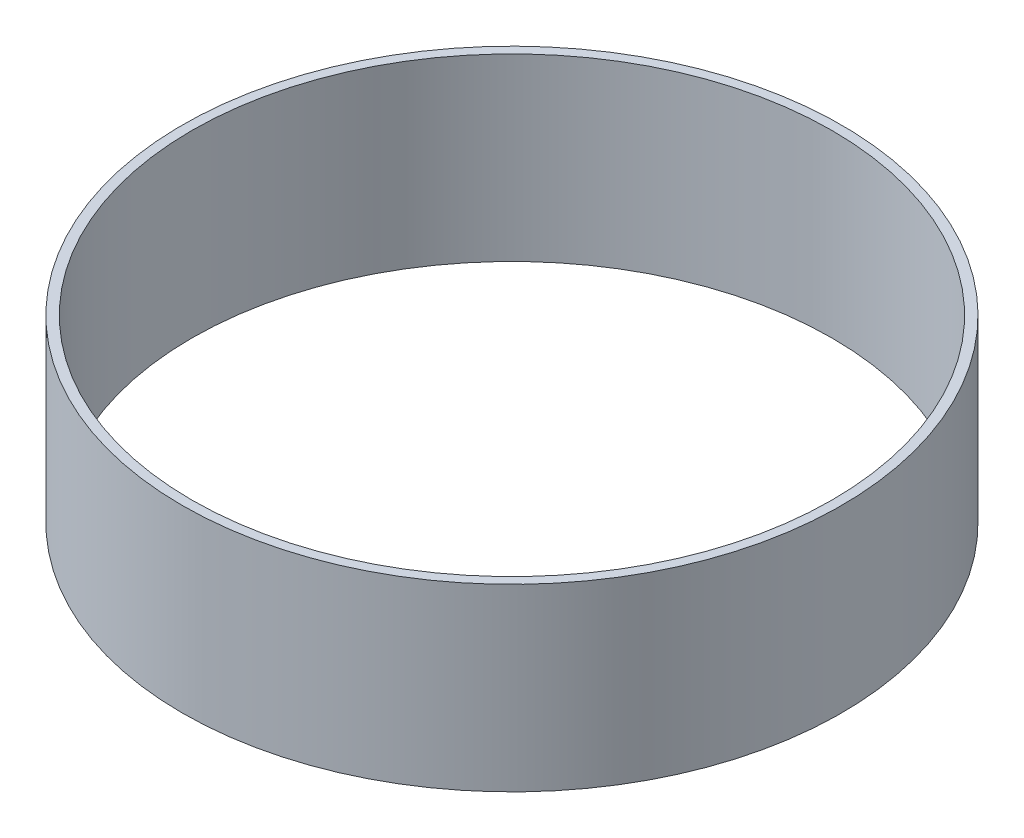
ISO-10303-21;
HEADER;
FILE_DESCRIPTION(('STEP AP214'),'2;1');
FILE_NAME('part.step','',(''),(''),'','','');
FILE_SCHEMA(('AUTOMOTIVE_DESIGN { 1 0 10303 214 1 1 1 1 }'));
ENDSEC;
DATA;
#1=APPLICATION_CONTEXT('core data for automotive mechanical design processes');
#2=APPLICATION_PROTOCOL_DEFINITION('international standard','automotive_design',2000,#1);
#3=PRODUCT_CONTEXT('',#1,'mechanical');
#4=PRODUCT('Part','Part','',(#3));
#5=PRODUCT_RELATED_PRODUCT_CATEGORY('part','',(#4));
#6=PRODUCT_DEFINITION_FORMATION('','',#4);
#7=PRODUCT_DEFINITION_CONTEXT('part definition',#1,'design');
#8=PRODUCT_DEFINITION('design','',#6,#7);
#9=PRODUCT_DEFINITION_SHAPE('','',#8);
#10=(LENGTH_UNIT() NAMED_UNIT(*) SI_UNIT(.MILLI.,.METRE.));
#11=(NAMED_UNIT(*) PLANE_ANGLE_UNIT() SI_UNIT($,.RADIAN.));
#12=(NAMED_UNIT(*) SI_UNIT($,.STERADIAN.) SOLID_ANGLE_UNIT());
#13=UNCERTAINTY_MEASURE_WITH_UNIT(LENGTH_MEASURE(1.E-05),#10,'distance_accuracy_value','');
#14=(GEOMETRIC_REPRESENTATION_CONTEXT(3) GLOBAL_UNCERTAINTY_ASSIGNED_CONTEXT((#13)) GLOBAL_UNIT_ASSIGNED_CONTEXT((#10,
#11,#12)) REPRESENTATION_CONTEXT('',''));
#15=CARTESIAN_POINT('',(0.,0.,0.));
#16=DIRECTION('',(0.,0.,1.));
#17=DIRECTION('',(1.,0.,0.));
#18=AXIS2_PLACEMENT_3D('',#15,#16,#17);
#19=CARTESIAN_POINT('',(0.,18.,0.));
#20=DIRECTION('',(0.,1.,0.));
#21=DIRECTION('',(0.,0.,1.));
#22=AXIS2_PLACEMENT_3D('',#19,#20,#21);
#23=PLANE('',#22);
#24=CARTESIAN_POINT('',(0.,18.,0.));
#25=DIRECTION('',(0.,1.,0.));
#26=DIRECTION('',(0.,0.,1.));
#27=AXIS2_PLACEMENT_3D('',#24,#25,#26);
#28=CIRCLE('',#27,33.);
#29=CARTESIAN_POINT('',(0.,18.,33.));
#30=VERTEX_POINT('',#29);
#31=EDGE_CURVE('E10',#30,#30,#28,.T.);
#32=ORIENTED_EDGE('',*,*,#31,.T.);
#33=EDGE_LOOP('',(#32));
#34=FACE_BOUND('',#33,.T.);
#35=CARTESIAN_POINT('',(0.,18.,0.));
#36=DIRECTION('',(0.,1.,0.));
#37=DIRECTION('',(0.,0.,1.));
#38=AXIS2_PLACEMENT_3D('',#35,#36,#37);
#39=CIRCLE('',#38,32.05);
#40=CARTESIAN_POINT('',(0.,18.,32.05));
#41=VERTEX_POINT('',#40);
#42=EDGE_CURVE('E50',#41,#41,#39,.T.);
#43=ORIENTED_EDGE('',*,*,#42,.F.);
#44=EDGE_LOOP('',(#43));
#45=FACE_BOUND('',#44,.T.);
#46=ADVANCED_FACE('F37',(#34,#45),#23,.T.);
#47=CARTESIAN_POINT('',(0.,0.,0.));
#48=DIRECTION('',(0.,1.,0.));
#49=DIRECTION('',(0.,0.,1.));
#50=AXIS2_PLACEMENT_3D('',#47,#48,#49);
#51=PLANE('',#50);
#52=CARTESIAN_POINT('',(0.,0.,0.));
#53=DIRECTION('',(0.,1.,0.));
#54=DIRECTION('',(0.,0.,1.));
#55=AXIS2_PLACEMENT_3D('',#52,#53,#54);
#56=CIRCLE('',#55,33.);
#57=CARTESIAN_POINT('',(0.,0.,33.));
#58=VERTEX_POINT('',#57);
#59=EDGE_CURVE('E41',#58,#58,#56,.T.);
#60=ORIENTED_EDGE('',*,*,#59,.F.);
#61=EDGE_LOOP('',(#60));
#62=FACE_BOUND('',#61,.T.);
#63=CARTESIAN_POINT('',(0.,0.,0.));
#64=DIRECTION('',(0.,1.,0.));
#65=DIRECTION('',(0.,0.,1.));
#66=AXIS2_PLACEMENT_3D('',#63,#64,#65);
#67=CIRCLE('',#66,32.05);
#68=CARTESIAN_POINT('',(0.,0.,32.05));
#69=VERTEX_POINT('',#68);
#70=EDGE_CURVE('E52',#69,#69,#67,.T.);
#71=ORIENTED_EDGE('',*,*,#70,.T.);
#72=EDGE_LOOP('',(#71));
#73=FACE_BOUND('',#72,.T.);
#74=ADVANCED_FACE('F64',(#62,#73),#51,.F.);
#75=CARTESIAN_POINT('',(0.,18.,0.));
#76=DIRECTION('',(0.,-1.,0.));
#77=DIRECTION('',(0.,0.,-1.));
#78=AXIS2_PLACEMENT_3D('',#75,#76,#77);
#79=CYLINDRICAL_SURFACE('',#78,33.);
#80=ORIENTED_EDGE('',*,*,#31,.F.);
#81=EDGE_LOOP('',(#80));
#82=FACE_BOUND('',#81,.T.);
#83=ORIENTED_EDGE('',*,*,#59,.T.);
#84=EDGE_LOOP('',(#83));
#85=FACE_BOUND('',#84,.T.);
#86=ADVANCED_FACE('F39',(#82,#85),#79,.T.);
#87=CARTESIAN_POINT('',(0.,18.,0.));
#88=DIRECTION('',(0.,-1.,0.));
#89=DIRECTION('',(0.,0.,-1.));
#90=AXIS2_PLACEMENT_3D('',#87,#88,#89);
#91=CYLINDRICAL_SURFACE('',#90,32.05);
#92=ORIENTED_EDGE('',*,*,#42,.T.);
#93=EDGE_LOOP('',(#92));
#94=FACE_BOUND('',#93,.T.);
#95=ORIENTED_EDGE('',*,*,#70,.F.);
#96=EDGE_LOOP('',(#95));
#97=FACE_BOUND('',#96,.T.);
#98=ADVANCED_FACE('F60',(#94,#97),#91,.F.);
#99=CLOSED_SHELL('',(#46,#74,#86,#98));
#100=MANIFOLD_SOLID_BREP('B2',#99);
#101=ADVANCED_BREP_SHAPE_REPRESENTATION('',(#18,#100),#14);
#102=SHAPE_DEFINITION_REPRESENTATION(#9,#101);
ENDSEC;
END-ISO-10303-21;
